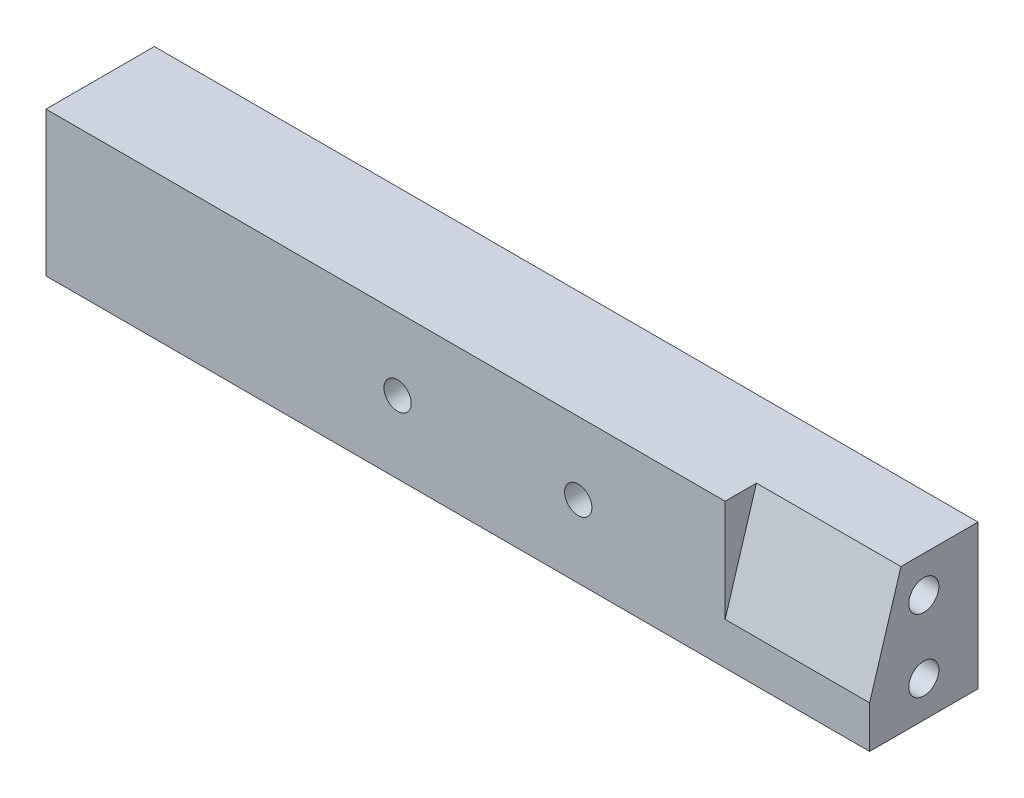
from build123d import *

# Parameters (mm, degrees)
RESSALTO_EXTRUS_O1_DEPTH      = 68.4
FURO_ROSCADO_DE_M3X0_51_D     = 2.5
FURO_ROSCADO_DE_M3X0_51_DEPTH = 8.5
FURO_ROSCADO_DE_M3X0_51_TIP   = 0.751075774
FURO_ROSCADO_DE_M3X0_52_D     = 2.5
FURO_ROSCADO_DE_M3X0_52_DEPTH = 8.5
FURO_ROSCADO_DE_M3X0_52_TIP   = 0.751075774
FURO_ROSCADO_DE_M3X0_55_D     = 2.5
FURO_ROSCADO_DE_M3X0_55_DEPTH = 8.93
FURO_ROSCADO_DE_M3X0_55_TIP   = 0.751075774
CORTE_EXTRUS_O1_DEPTH         = 12


with BuildPart() as part:
    # Esbo_o1 → Ressalto-extrus_o1 (new body)
    with BuildSketch(Plane(origin=(0, 0, 0), x_dir=(0, 0, -1), z_dir=(1, 0, 0))):
        Polygon((3.026585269, 6), (4.5, 6), (4.5, -6), (-4.5, -6), (-4.5, 6), align=None)
    extrude(amount=RESSALTO_EXTRUS_O1_DEPTH)

    # Furo roscado de M3x0.51
    with Locations(Plane(origin=(68.4, 0, 0), x_dir=(0, 0, -1), z_dir=(1, 0, 0))):
        with Locations((0, -3), (0, 3)):
            Hole(FURO_ROSCADO_DE_M3X0_51_D / 2, depth=FURO_ROSCADO_DE_M3X0_51_DEPTH)
            with Locations((0, 0, -(FURO_ROSCADO_DE_M3X0_51_DEPTH + FURO_ROSCADO_DE_M3X0_51_TIP / 2))):  # 118° drill point
                Cone(0, FURO_ROSCADO_DE_M3X0_51_D / 2, FURO_ROSCADO_DE_M3X0_51_TIP, mode=Mode.SUBTRACT)

    # Furo roscado de M3x0.52
    with Locations(Plane.ZY):
        with Locations((0, 3), (0, -3)):
            Hole(FURO_ROSCADO_DE_M3X0_52_D / 2, depth=FURO_ROSCADO_DE_M3X0_52_DEPTH)
            with Locations((0, 0, -(FURO_ROSCADO_DE_M3X0_52_DEPTH + FURO_ROSCADO_DE_M3X0_52_TIP / 2))):  # 118° drill point
                Cone(0, FURO_ROSCADO_DE_M3X0_52_D / 2, FURO_ROSCADO_DE_M3X0_52_TIP, mode=Mode.SUBTRACT)

    # Furo roscado de M3x0.55
    with Locations(Plane(origin=(44.2, 0, -4.5), x_dir=(-1, 0, 0), z_dir=(0, 0, -1))):
        with Locations((0, 0), (15, 0)):
            Hole(FURO_ROSCADO_DE_M3X0_55_D / 2, depth=FURO_ROSCADO_DE_M3X0_55_DEPTH)
            with Locations((0, 0, -(FURO_ROSCADO_DE_M3X0_55_DEPTH + FURO_ROSCADO_DE_M3X0_55_TIP / 2))):  # 118° drill point
                Cone(0, FURO_ROSCADO_DE_M3X0_55_D / 2, FURO_ROSCADO_DE_M3X0_55_TIP, mode=Mode.SUBTRACT)

    # Esbo_o2 → Corte-extrus_o1 (cut)
    with BuildSketch(Plane(origin=(68.4, 0, 0), x_dir=(0, 0, -1), z_dir=(1, 0, 0))):
        Polygon((-1.9, 6), (-4.5, -2.5), (-4.5, 6), align=None)
    extrude(amount=-CORTE_EXTRUS_O1_DEPTH, mode=Mode.SUBTRACT)


solid = part.part
